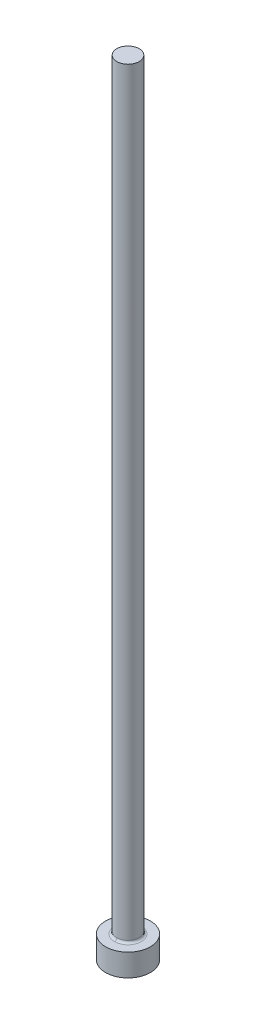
ISO-10303-21;
HEADER;
FILE_DESCRIPTION(('STEP AP214'),'2;1');
FILE_NAME('part.step','',(''),(''),'','','');
FILE_SCHEMA(('AUTOMOTIVE_DESIGN { 1 0 10303 214 1 1 1 1 }'));
ENDSEC;
DATA;
#1=APPLICATION_CONTEXT('core data for automotive mechanical design processes');
#2=APPLICATION_PROTOCOL_DEFINITION('international standard','automotive_design',2000,#1);
#3=PRODUCT_CONTEXT('',#1,'mechanical');
#4=PRODUCT('Part','Part','',(#3));
#5=PRODUCT_RELATED_PRODUCT_CATEGORY('part','',(#4));
#6=PRODUCT_DEFINITION_FORMATION('','',#4);
#7=PRODUCT_DEFINITION_CONTEXT('part definition',#1,'design');
#8=PRODUCT_DEFINITION('design','',#6,#7);
#9=PRODUCT_DEFINITION_SHAPE('','',#8);
#10=(LENGTH_UNIT() NAMED_UNIT(*) SI_UNIT(.MILLI.,.METRE.));
#11=(NAMED_UNIT(*) PLANE_ANGLE_UNIT() SI_UNIT($,.RADIAN.));
#12=(NAMED_UNIT(*) SI_UNIT($,.STERADIAN.) SOLID_ANGLE_UNIT());
#13=UNCERTAINTY_MEASURE_WITH_UNIT(LENGTH_MEASURE(1.E-05),#10,'distance_accuracy_value','');
#14=(GEOMETRIC_REPRESENTATION_CONTEXT(3) GLOBAL_UNCERTAINTY_ASSIGNED_CONTEXT((#13)) GLOBAL_UNIT_ASSIGNED_CONTEXT((#10,
#11,#12)) REPRESENTATION_CONTEXT('',''));
#15=CARTESIAN_POINT('',(0.,0.,0.));
#16=DIRECTION('',(0.,0.,1.));
#17=DIRECTION('',(1.,0.,0.));
#18=AXIS2_PLACEMENT_3D('',#15,#16,#17);
#19=CARTESIAN_POINT('',(-11.536,-106.,103.0935));
#20=DIRECTION('',(0.,-1.,0.));
#21=DIRECTION('',(0.,0.,-1.));
#22=AXIS2_PLACEMENT_3D('',#19,#20,#21);
#23=PLANE('',#22);
#24=CARTESIAN_POINT('',(-8.5,-106.,100.0575));
#25=DIRECTION('',(0.,1.,0.));
#26=DIRECTION('',(-1.,0.,0.));
#27=AXIS2_PLACEMENT_3D('',#24,#25,#26);
#28=CIRCLE('',#27,3.);
#29=CARTESIAN_POINT('',(-11.5,-106.,100.0575));
#30=VERTEX_POINT('',#29);
#31=EDGE_CURVE('E29',#30,#30,#28,.F.);
#32=ORIENTED_EDGE('',*,*,#31,.T.);
#33=EDGE_LOOP('',(#32));
#34=FACE_BOUND('',#33,.T.);
#35=ADVANCED_FACE('F24',(#34),#23,.T.);
#36=CARTESIAN_POINT('',(-8.5,-106.,100.0575));
#37=DIRECTION('',(0.,1.,0.));
#38=DIRECTION('',(-1.,0.,0.));
#39=AXIS2_PLACEMENT_3D('',#36,#37,#38);
#40=CYLINDRICAL_SURFACE('',#39,3.);
#41=CARTESIAN_POINT('',(-8.50000000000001,-103.,100.0575));
#42=DIRECTION('',(0.,1.,0.));
#43=DIRECTION('',(-1.,0.,0.));
#44=AXIS2_PLACEMENT_3D('',#41,#42,#43);
#45=CIRCLE('',#44,3.);
#46=CARTESIAN_POINT('',(-11.5,-103.,100.0575));
#47=VERTEX_POINT('',#46);
#48=EDGE_CURVE('E66',#47,#47,#45,.T.);
#49=ORIENTED_EDGE('',*,*,#48,.F.);
#50=EDGE_LOOP('',(#49));
#51=FACE_BOUND('',#50,.T.);
#52=ORIENTED_EDGE('',*,*,#31,.F.);
#53=EDGE_LOOP('',(#52));
#54=FACE_BOUND('',#53,.T.);
#55=ADVANCED_FACE('F101',(#51,#54),#40,.T.);
#56=CARTESIAN_POINT('',(-8.5,-102.99850125,101.887450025));
#57=CARTESIAN_POINT('',(-4.84009995,-102.99850125,101.887450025));
#58=CARTESIAN_POINT('',(-4.84009995,-102.99850125,98.227549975));
#59=CARTESIAN_POINT('',(-8.5,-102.99850125,98.227549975));
#60=CARTESIAN_POINT('',(-8.5,-103.018966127,101.68348387));
#61=CARTESIAN_POINT('',(-5.248032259,-103.018966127,101.68348387));
#62=CARTESIAN_POINT('',(-5.248032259,-103.018966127,98.43151613));
#63=CARTESIAN_POINT('',(-8.5,-103.018966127,98.43151613));
#64=CARTESIAN_POINT('',(-8.5,-102.87401613,101.538533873));
#65=CARTESIAN_POINT('',(-5.537932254,-102.87401613,101.538533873));
#66=CARTESIAN_POINT('',(-5.537932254,-102.87401613,98.576466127));
#67=CARTESIAN_POINT('',(-8.5,-102.87401613,98.576466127));
#68=CARTESIAN_POINT('',(-8.5,-102.670049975,101.55899875));
#69=CARTESIAN_POINT('',(-5.497002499,-102.670049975,101.55899875));
#70=CARTESIAN_POINT('',(-5.497002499,-102.670049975,98.55600125));
#71=CARTESIAN_POINT('',(-8.5,-102.670049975,98.55600125));
#72=(BOUNDED_SURFACE() B_SPLINE_SURFACE(3,3,((#56,#57,#58,#59),(#60,#61,#62,#63),(#64,#65,#66,
#67),(#68,#69,#70,#71)),.UNSPECIFIED.,.F.,.F.,.F.) B_SPLINE_SURFACE_WITH_KNOTS((4,4),(4,4),(0.,
1.),(0.,1.),.UNSPECIFIED.) GEOMETRIC_REPRESENTATION_ITEM() RATIONAL_B_SPLINE_SURFACE(((1.,
0.333333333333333,0.333333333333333,1.),(0.75532087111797,0.25177362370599,0.25177362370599,
0.75532087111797),(0.75532087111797,0.25177362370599,0.25177362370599,0.75532087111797),(1.,
0.333333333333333,0.333333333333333,1.))) REPRESENTATION_ITEM('') SURFACE());
#73=CARTESIAN_POINT('',(-8.5,-102.7,100.0575));
#74=DIRECTION('',(0.,1.,0.));
#75=DIRECTION('',(0.,0.,1.));
#76=AXIS2_PLACEMENT_3D('',#73,#74,#75);
#77=CIRCLE('',#76,1.5);
#78=CARTESIAN_POINT('',(-8.50000000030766,-102.70000000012,98.5575000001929));
#79=VERTEX_POINT('',#78);
#80=CARTESIAN_POINT('',(-8.50000000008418,-102.700000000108,101.557499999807));
#81=VERTEX_POINT('',#80);
#82=EDGE_CURVE('E59',#79,#81,#77,.F.);
#83=CARTESIAN_POINT('',(-8.5,-102.99850125,101.887450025));
#84=CARTESIAN_POINT('',(-8.5,-103.018966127,101.68348387));
#85=CARTESIAN_POINT('',(-8.5,-102.87401613,101.538533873));
#86=CARTESIAN_POINT('',(-8.5,-102.670049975,101.55899875));
#87=(BOUNDED_CURVE() B_SPLINE_CURVE(3,(#83,#84,#85,#86),.UNSPECIFIED.,.F.,
.F.) B_SPLINE_CURVE_WITH_KNOTS((4,4),(0.,1.),
.UNSPECIFIED.) CURVE() GEOMETRIC_REPRESENTATION_ITEM() RATIONAL_B_SPLINE_CURVE((1.,
0.75532087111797,0.75532087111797,1.)) REPRESENTATION_ITEM(''));
#88=CARTESIAN_POINT('',(-8.5,-103.000000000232,101.857500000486));
#89=VERTEX_POINT('',#88);
#90=EDGE_CURVE('E53',#89,#81,#87,.T.);
#91=CARTESIAN_POINT('',(-8.5,-103.000000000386,101.857499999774));
#92=CARTESIAN_POINT('',(-4.90000000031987,-103.000000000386,101.857499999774));
#93=CARTESIAN_POINT('',(-4.90000000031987,-103.000000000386,98.2575000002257));
#94=CARTESIAN_POINT('',(-8.5,-103.000000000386,98.2575000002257));
#95=(BOUNDED_CURVE() B_SPLINE_CURVE(3,(#91,#92,#93,#94),.UNSPECIFIED.,.F.,
.F.) B_SPLINE_CURVE_WITH_KNOTS((4,4),(0.,1.),
.UNSPECIFIED.) CURVE() GEOMETRIC_REPRESENTATION_ITEM() RATIONAL_B_SPLINE_CURVE((0.956578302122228,
0.318859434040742,0.318859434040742,0.956578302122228)) REPRESENTATION_ITEM(''));
#96=CARTESIAN_POINT('',(-8.5,-103.000000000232,98.2574999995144));
#97=VERTEX_POINT('',#96);
#98=EDGE_CURVE('E56',#97,#89,#95,.F.);
#99=CARTESIAN_POINT('',(-8.5,-102.99850125,98.227549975));
#100=CARTESIAN_POINT('',(-8.5,-103.018966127,98.43151613));
#101=CARTESIAN_POINT('',(-8.5,-102.87401613,98.576466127));
#102=CARTESIAN_POINT('',(-8.5,-102.670049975,98.55600125));
#103=(BOUNDED_CURVE() B_SPLINE_CURVE(3,(#99,#100,#101,#102),.UNSPECIFIED.,.F.,
.F.) B_SPLINE_CURVE_WITH_KNOTS((4,4),(0.,1.),
.UNSPECIFIED.) CURVE() GEOMETRIC_REPRESENTATION_ITEM() RATIONAL_B_SPLINE_CURVE((1.,
0.75532087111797,0.75532087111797,1.)) REPRESENTATION_ITEM(''));
#104=EDGE_CURVE('E44',#79,#97,#103,.F.);
#105=ORIENTED_EDGE('',*,*,#82,.T.);
#106=ORIENTED_EDGE('',*,*,#90,.F.);
#107=ORIENTED_EDGE('',*,*,#98,.F.);
#108=ORIENTED_EDGE('',*,*,#104,.F.);
#109=EDGE_LOOP('',(#105,#106,#107,#108));
#110=FACE_BOUND('',#109,.T.);
#111=ADVANCED_FACE('F55',(#110),#72,.F.);
#112=CARTESIAN_POINT('',(-10.018,-1.015,98.5395));
#113=DIRECTION('',(0.,1.,0.));
#114=DIRECTION('',(0.,0.,1.));
#115=AXIS2_PLACEMENT_3D('',#112,#113,#114);
#116=PLANE('',#115);
#117=CARTESIAN_POINT('',(-8.50000000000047,-1.015,100.0575));
#118=DIRECTION('',(0.,1.,0.));
#119=DIRECTION('',(-1.,0.,0.));
#120=AXIS2_PLACEMENT_3D('',#117,#118,#119);
#121=CIRCLE('',#120,1.5);
#122=CARTESIAN_POINT('',(-10.0000000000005,-1.01500000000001,100.0575));
#123=VERTEX_POINT('',#122);
#124=EDGE_CURVE('E65',#123,#123,#121,.T.);
#125=ORIENTED_EDGE('',*,*,#124,.T.);
#126=EDGE_LOOP('',(#125));
#127=FACE_BOUND('',#126,.T.);
#128=ADVANCED_FACE('F100',(#127),#116,.T.);
#129=CARTESIAN_POINT('',(-11.536,-103.,97.0215));
#130=DIRECTION('',(0.,1.,0.));
#131=DIRECTION('',(0.,0.,1.));
#132=AXIS2_PLACEMENT_3D('',#129,#130,#131);
#133=PLANE('',#132);
#134=CARTESIAN_POINT('',(-8.5,-103.000000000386,98.2575000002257));
#135=CARTESIAN_POINT('',(-12.0999999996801,-103.000000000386,98.2575000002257));
#136=CARTESIAN_POINT('',(-12.0999999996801,-103.000000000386,101.857499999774));
#137=CARTESIAN_POINT('',(-8.5,-103.000000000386,101.857499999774));
#138=(BOUNDED_CURVE() B_SPLINE_CURVE(3,(#134,#135,#136,#137),.UNSPECIFIED.,.F.,
.F.) B_SPLINE_CURVE_WITH_KNOTS((4,4),(0.,1.),
.UNSPECIFIED.) CURVE() GEOMETRIC_REPRESENTATION_ITEM() RATIONAL_B_SPLINE_CURVE((0.956578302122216,
0.318859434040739,0.318859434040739,0.956578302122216)) REPRESENTATION_ITEM(''));
#139=EDGE_CURVE('E35',#89,#97,#138,.F.);
#140=ORIENTED_EDGE('',*,*,#139,.T.);
#141=ORIENTED_EDGE('',*,*,#98,.T.);
#142=EDGE_LOOP('',(#140,#141));
#143=FACE_BOUND('',#142,.T.);
#144=ORIENTED_EDGE('',*,*,#48,.T.);
#145=EDGE_LOOP('',(#144));
#146=FACE_BOUND('',#145,.T.);
#147=ADVANCED_FACE('F26',(#143,#146),#133,.T.);
#148=CARTESIAN_POINT('',(-8.5,-102.7,100.0575));
#149=DIRECTION('',(0.,1.,0.));
#150=DIRECTION('',(-1.,0.,0.));
#151=AXIS2_PLACEMENT_3D('',#148,#149,#150);
#152=CYLINDRICAL_SURFACE('',#151,1.5);
#153=CARTESIAN_POINT('',(-8.5,-102.700000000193,100.0575));
#154=DIRECTION('',(0.,1.,0.));
#155=DIRECTION('',(-1.,0.,0.));
#156=AXIS2_PLACEMENT_3D('',#153,#154,#155);
#157=CIRCLE('',#156,1.49999999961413);
#158=EDGE_CURVE('E13',#79,#81,#157,.T.);
#159=ORIENTED_EDGE('',*,*,#158,.T.);
#160=ORIENTED_EDGE('',*,*,#82,.F.);
#161=EDGE_LOOP('',(#159,#160));
#162=FACE_BOUND('',#161,.T.);
#163=ORIENTED_EDGE('',*,*,#124,.F.);
#164=EDGE_LOOP('',(#163));
#165=FACE_BOUND('',#164,.T.);
#166=ADVANCED_FACE('F86',(#162,#165),#152,.T.);
#167=CARTESIAN_POINT('',(-8.5,-102.99850125,98.227549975));
#168=CARTESIAN_POINT('',(-12.15990005,-102.99850125,98.227549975));
#169=CARTESIAN_POINT('',(-12.15990005,-102.99850125,101.887450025));
#170=CARTESIAN_POINT('',(-8.5,-102.99850125,101.887450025));
#171=CARTESIAN_POINT('',(-8.5,-103.018966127,98.43151613));
#172=CARTESIAN_POINT('',(-11.751967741,-103.018966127,98.43151613));
#173=CARTESIAN_POINT('',(-11.751967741,-103.018966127,101.68348387));
#174=CARTESIAN_POINT('',(-8.5,-103.018966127,101.68348387));
#175=CARTESIAN_POINT('',(-8.5,-102.87401613,98.576466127));
#176=CARTESIAN_POINT('',(-11.462067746,-102.87401613,98.576466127));
#177=CARTESIAN_POINT('',(-11.462067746,-102.87401613,101.538533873));
#178=CARTESIAN_POINT('',(-8.5,-102.87401613,101.538533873));
#179=CARTESIAN_POINT('',(-8.5,-102.670049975,98.55600125));
#180=CARTESIAN_POINT('',(-11.502997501,-102.670049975,98.55600125));
#181=CARTESIAN_POINT('',(-11.502997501,-102.670049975,101.55899875));
#182=CARTESIAN_POINT('',(-8.5,-102.670049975,101.55899875));
#183=(BOUNDED_SURFACE() B_SPLINE_SURFACE(3,3,((#167,#168,#169,#170),(#171,#172,#173,#174),(#175,
#176,#177,#178),(#179,#180,#181,#182)),.UNSPECIFIED.,.F.,.F.,
.F.) B_SPLINE_SURFACE_WITH_KNOTS((4,4),(4,4),(0.,1.),(0.,1.),
.UNSPECIFIED.) GEOMETRIC_REPRESENTATION_ITEM() RATIONAL_B_SPLINE_SURFACE(((1.,0.333333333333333,
0.333333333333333,1.),(0.75532087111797,0.25177362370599,0.25177362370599,0.75532087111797),
(0.75532087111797,0.25177362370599,0.25177362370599,0.75532087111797),(1.,0.333333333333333,
0.333333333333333,1.))) REPRESENTATION_ITEM('') SURFACE());
#184=ORIENTED_EDGE('',*,*,#104,.T.);
#185=ORIENTED_EDGE('',*,*,#139,.F.);
#186=ORIENTED_EDGE('',*,*,#90,.T.);
#187=ORIENTED_EDGE('',*,*,#158,.F.);
#188=EDGE_LOOP('',(#184,#185,#186,#187));
#189=FACE_BOUND('',#188,.T.);
#190=ADVANCED_FACE('F70',(#189),#183,.F.);
#191=CLOSED_SHELL('',(#35,#55,#111,#128,#147,#166,#190));
#192=MANIFOLD_SOLID_BREP('B1',#191);
#193=ADVANCED_BREP_SHAPE_REPRESENTATION('',(#18,#192),#14);
#194=SHAPE_DEFINITION_REPRESENTATION(#9,#193);
ENDSEC;
END-ISO-10303-21;
